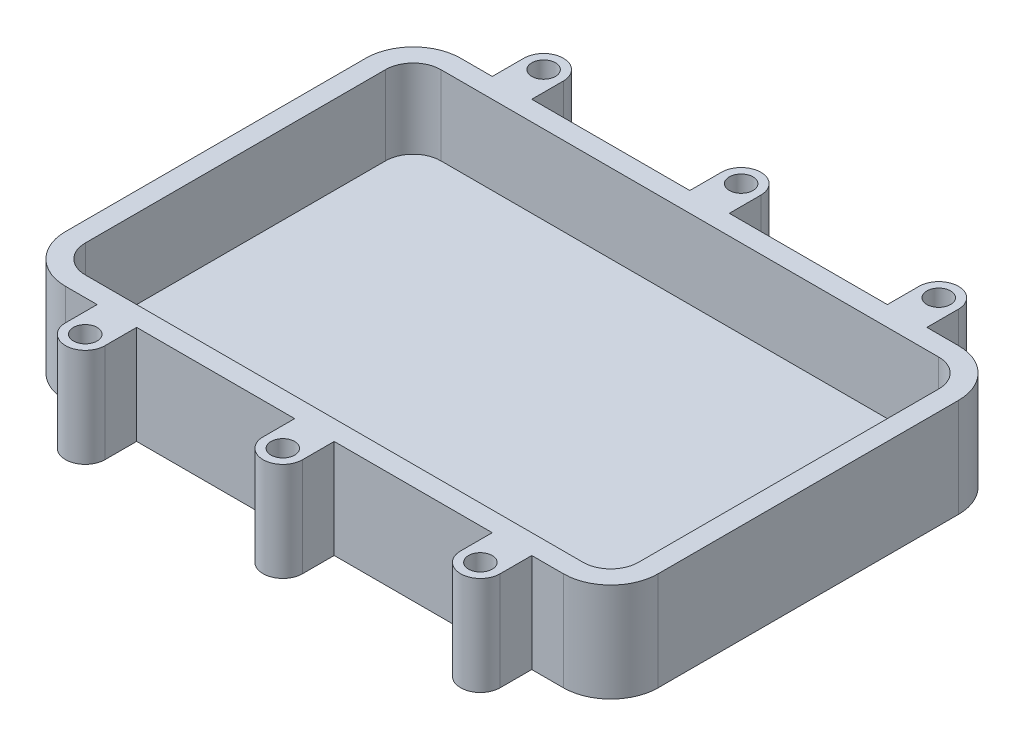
ISO-10303-21;
HEADER;
FILE_DESCRIPTION(('STEP AP214'),'2;1');
FILE_NAME('part.step','',(''),(''),'','','');
FILE_SCHEMA(('AUTOMOTIVE_DESIGN { 1 0 10303 214 1 1 1 1 }'));
ENDSEC;
DATA;
#1=APPLICATION_CONTEXT('core data for automotive mechanical design processes');
#2=APPLICATION_PROTOCOL_DEFINITION('international standard','automotive_design',2000,#1);
#3=PRODUCT_CONTEXT('',#1,'mechanical');
#4=PRODUCT('Part','Part','',(#3));
#5=PRODUCT_RELATED_PRODUCT_CATEGORY('part','',(#4));
#6=PRODUCT_DEFINITION_FORMATION('','',#4);
#7=PRODUCT_DEFINITION_CONTEXT('part definition',#1,'design');
#8=PRODUCT_DEFINITION('design','',#6,#7);
#9=PRODUCT_DEFINITION_SHAPE('','',#8);
#10=(LENGTH_UNIT() NAMED_UNIT(*) SI_UNIT(.MILLI.,.METRE.));
#11=(NAMED_UNIT(*) PLANE_ANGLE_UNIT() SI_UNIT($,.RADIAN.));
#12=(NAMED_UNIT(*) SI_UNIT($,.STERADIAN.) SOLID_ANGLE_UNIT());
#13=UNCERTAINTY_MEASURE_WITH_UNIT(LENGTH_MEASURE(1.E-05),#10,'distance_accuracy_value','');
#14=(GEOMETRIC_REPRESENTATION_CONTEXT(3) GLOBAL_UNCERTAINTY_ASSIGNED_CONTEXT((#13)) GLOBAL_UNIT_ASSIGNED_CONTEXT((#10,
#11,#12)) REPRESENTATION_CONTEXT('',''));
#15=CARTESIAN_POINT('',(0.,0.,0.));
#16=DIRECTION('',(0.,0.,1.));
#17=DIRECTION('',(1.,0.,0.));
#18=AXIS2_PLACEMENT_3D('',#15,#16,#17);
#19=CARTESIAN_POINT('',(-63.,0.,-38.));
#20=DIRECTION('',(0.,-1.,0.));
#21=DIRECTION('',(0.,0.,-1.));
#22=AXIS2_PLACEMENT_3D('',#19,#20,#21);
#23=PLANE('',#22);
#24=CARTESIAN_POINT('',(50.,0.,58.));
#25=DIRECTION('',(0.,1.,0.));
#26=DIRECTION('',(0.,0.,1.));
#27=AXIS2_PLACEMENT_3D('',#24,#25,#26);
#28=CIRCLE('',#27,3.);
#29=CARTESIAN_POINT('',(50.,0.,61.));
#30=VERTEX_POINT('',#29);
#31=EDGE_CURVE('E1111',#30,#30,#28,.T.);
#32=ORIENTED_EDGE('',*,*,#31,.T.);
#33=EDGE_LOOP('',(#32));
#34=FACE_BOUND('',#33,.T.);
#35=CARTESIAN_POINT('',(0.,0.,-58.));
#36=DIRECTION('',(0.,1.,0.));
#37=DIRECTION('',(0.,0.,1.));
#38=AXIS2_PLACEMENT_3D('',#35,#36,#37);
#39=CIRCLE('',#38,2.99999999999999);
#40=CARTESIAN_POINT('',(0.,0.,-55.));
#41=VERTEX_POINT('',#40);
#42=EDGE_CURVE('E369',#41,#41,#39,.T.);
#43=ORIENTED_EDGE('',*,*,#42,.T.);
#44=EDGE_LOOP('',(#43));
#45=FACE_BOUND('',#44,.T.);
#46=CARTESIAN_POINT('',(-50.,0.,-58.));
#47=DIRECTION('',(0.,1.,0.));
#48=DIRECTION('',(0.,0.,1.));
#49=AXIS2_PLACEMENT_3D('',#46,#47,#48);
#50=CIRCLE('',#49,3.);
#51=CARTESIAN_POINT('',(-50.,0.,-55.));
#52=VERTEX_POINT('',#51);
#53=EDGE_CURVE('E389',#52,#52,#50,.T.);
#54=ORIENTED_EDGE('',*,*,#53,.T.);
#55=EDGE_LOOP('',(#54));
#56=FACE_BOUND('',#55,.T.);
#57=CARTESIAN_POINT('',(-63.,0.,-38.));
#58=DIRECTION('',(0.,1.,0.));
#59=DIRECTION('',(0.,0.,-1.));
#60=AXIS2_PLACEMENT_3D('',#57,#58,#59);
#61=CIRCLE('',#60,12.);
#62=CARTESIAN_POINT('',(-63.,0.,-50.));
#63=VERTEX_POINT('',#62);
#64=CARTESIAN_POINT('',(-75.,0.,-38.));
#65=VERTEX_POINT('',#64);
#66=EDGE_CURVE('E484',#63,#65,#61,.T.);
#67=ORIENTED_EDGE('',*,*,#66,.F.);
#68=DIRECTION('',(-1.,0.,0.));
#69=VECTOR('',#68,1.);
#70=CARTESIAN_POINT('',(63.,0.,-50.));
#71=LINE('',#70,#69);
#72=CARTESIAN_POINT('',(-55.,0.,-50.));
#73=VERTEX_POINT('',#72);
#74=EDGE_CURVE('E554',#73,#63,#71,.T.);
#75=ORIENTED_EDGE('',*,*,#74,.F.);
#76=DIRECTION('',(0.,0.,1.));
#77=VECTOR('',#76,1.);
#78=CARTESIAN_POINT('',(-55.,0.,-50.));
#79=LINE('',#78,#77);
#80=CARTESIAN_POINT('',(-55.,0.,-58.));
#81=VERTEX_POINT('',#80);
#82=EDGE_CURVE('E437',#81,#73,#79,.T.);
#83=ORIENTED_EDGE('',*,*,#82,.F.);
#84=CARTESIAN_POINT('',(-50.,0.,-58.));
#85=DIRECTION('',(0.,1.,0.));
#86=DIRECTION('',(0.,0.,1.));
#87=AXIS2_PLACEMENT_3D('',#84,#85,#86);
#88=CIRCLE('',#87,5.);
#89=CARTESIAN_POINT('',(-45.,0.,-58.));
#90=VERTEX_POINT('',#89);
#91=EDGE_CURVE('E434',#90,#81,#88,.T.);
#92=ORIENTED_EDGE('',*,*,#91,.F.);
#93=DIRECTION('',(0.,0.,-1.));
#94=VECTOR('',#93,1.);
#95=CARTESIAN_POINT('',(-45.,0.,-50.));
#96=LINE('',#95,#94);
#97=CARTESIAN_POINT('',(-45.,0.,-50.));
#98=VERTEX_POINT('',#97);
#99=EDGE_CURVE('E431',#98,#90,#96,.T.);
#100=ORIENTED_EDGE('',*,*,#99,.F.);
#101=CARTESIAN_POINT('',(-5.,0.,-50.));
#102=VERTEX_POINT('',#101);
#103=EDGE_CURVE('E559',#102,#98,#71,.T.);
#104=ORIENTED_EDGE('',*,*,#103,.F.);
#105=DIRECTION('',(0.,0.,1.));
#106=VECTOR('',#105,1.);
#107=CARTESIAN_POINT('',(-5.,0.,-50.));
#108=LINE('',#107,#106);
#109=CARTESIAN_POINT('',(-5.,0.,-58.));
#110=VERTEX_POINT('',#109);
#111=EDGE_CURVE('E464',#110,#102,#108,.T.);
#112=ORIENTED_EDGE('',*,*,#111,.F.);
#113=CARTESIAN_POINT('',(0.,0.,-58.));
#114=DIRECTION('',(0.,1.,0.));
#115=DIRECTION('',(0.,0.,1.));
#116=AXIS2_PLACEMENT_3D('',#113,#114,#115);
#117=CIRCLE('',#116,5.);
#118=CARTESIAN_POINT('',(5.,0.,-58.));
#119=VERTEX_POINT('',#118);
#120=EDGE_CURVE('E461',#119,#110,#117,.T.);
#121=ORIENTED_EDGE('',*,*,#120,.F.);
#122=DIRECTION('',(0.,0.,-1.));
#123=VECTOR('',#122,1.);
#124=CARTESIAN_POINT('',(5.,0.,-50.));
#125=LINE('',#124,#123);
#126=CARTESIAN_POINT('',(5.,0.,-50.));
#127=VERTEX_POINT('',#126);
#128=EDGE_CURVE('E458',#127,#119,#125,.T.);
#129=ORIENTED_EDGE('',*,*,#128,.F.);
#130=CARTESIAN_POINT('',(45.,0.,-50.));
#131=VERTEX_POINT('',#130);
#132=EDGE_CURVE('E558',#131,#127,#71,.T.);
#133=ORIENTED_EDGE('',*,*,#132,.F.);
#134=DIRECTION('',(0.,0.,1.));
#135=VECTOR('',#134,1.);
#136=CARTESIAN_POINT('',(45.,0.,-50.));
#137=LINE('',#136,#135);
#138=CARTESIAN_POINT('',(45.,0.,-58.));
#139=VERTEX_POINT('',#138);
#140=EDGE_CURVE('E407',#139,#131,#137,.T.);
#141=ORIENTED_EDGE('',*,*,#140,.F.);
#142=CARTESIAN_POINT('',(50.,0.,-58.));
#143=DIRECTION('',(0.,1.,0.));
#144=DIRECTION('',(0.,0.,-1.));
#145=AXIS2_PLACEMENT_3D('',#142,#143,#144);
#146=CIRCLE('',#145,5.);
#147=CARTESIAN_POINT('',(55.,0.,-58.));
#148=VERTEX_POINT('',#147);
#149=EDGE_CURVE('E404',#148,#139,#146,.T.);
#150=ORIENTED_EDGE('',*,*,#149,.F.);
#151=DIRECTION('',(0.,0.,-1.));
#152=VECTOR('',#151,1.);
#153=CARTESIAN_POINT('',(55.,0.,-50.));
#154=LINE('',#153,#152);
#155=CARTESIAN_POINT('',(55.,0.,-50.));
#156=VERTEX_POINT('',#155);
#157=EDGE_CURVE('E410',#156,#148,#154,.T.);
#158=ORIENTED_EDGE('',*,*,#157,.F.);
#159=CARTESIAN_POINT('',(63.,0.,-50.));
#160=VERTEX_POINT('',#159);
#161=EDGE_CURVE('E555',#160,#156,#71,.T.);
#162=ORIENTED_EDGE('',*,*,#161,.F.);
#163=CARTESIAN_POINT('',(63.,0.,-38.));
#164=DIRECTION('',(0.,1.,0.));
#165=DIRECTION('',(0.,0.,-1.));
#166=AXIS2_PLACEMENT_3D('',#163,#164,#165);
#167=CIRCLE('',#166,12.);
#168=CARTESIAN_POINT('',(75.,0.,-38.));
#169=VERTEX_POINT('',#168);
#170=EDGE_CURVE('E552',#169,#160,#167,.T.);
#171=ORIENTED_EDGE('',*,*,#170,.F.);
#172=DIRECTION('',(0.,0.,-1.));
#173=VECTOR('',#172,1.);
#174=CARTESIAN_POINT('',(75.,0.,-38.));
#175=LINE('',#174,#173);
#176=CARTESIAN_POINT('',(75.,0.,38.));
#177=VERTEX_POINT('',#176);
#178=EDGE_CURVE('E550',#177,#169,#175,.T.);
#179=ORIENTED_EDGE('',*,*,#178,.F.);
#180=CARTESIAN_POINT('',(63.,0.,38.));
#181=DIRECTION('',(0.,1.,0.));
#182=DIRECTION('',(0.,0.,-1.));
#183=AXIS2_PLACEMENT_3D('',#180,#181,#182);
#184=CIRCLE('',#183,12.);
#185=CARTESIAN_POINT('',(63.,0.,50.));
#186=VERTEX_POINT('',#185);
#187=EDGE_CURVE('E546',#186,#177,#184,.T.);
#188=ORIENTED_EDGE('',*,*,#187,.F.);
#189=DIRECTION('',(1.,0.,0.));
#190=VECTOR('',#189,1.);
#191=CARTESIAN_POINT('',(63.,0.,50.));
#192=LINE('',#191,#190);
#193=CARTESIAN_POINT('',(55.,0.,50.));
#194=VERTEX_POINT('',#193);
#195=EDGE_CURVE('E542',#194,#186,#192,.T.);
#196=ORIENTED_EDGE('',*,*,#195,.F.);
#197=DIRECTION('',(0.,0.,1.));
#198=VECTOR('',#197,1.);
#199=CARTESIAN_POINT('',(55.,0.,50.));
#200=LINE('',#199,#198);
#201=CARTESIAN_POINT('',(55.,0.,58.));
#202=VERTEX_POINT('',#201);
#203=EDGE_CURVE('E321',#194,#202,#200,.T.);
#204=ORIENTED_EDGE('',*,*,#203,.T.);
#205=CARTESIAN_POINT('',(50.,0.,58.));
#206=DIRECTION('',(0.,-1.,0.));
#207=DIRECTION('',(0.,0.,1.));
#208=AXIS2_PLACEMENT_3D('',#205,#206,#207);
#209=CIRCLE('',#208,5.);
#210=CARTESIAN_POINT('',(45.,0.,58.));
#211=VERTEX_POINT('',#210);
#212=EDGE_CURVE('E304',#202,#211,#209,.T.);
#213=ORIENTED_EDGE('',*,*,#212,.T.);
#214=DIRECTION('',(0.,0.,-1.));
#215=VECTOR('',#214,1.);
#216=CARTESIAN_POINT('',(45.,0.,50.));
#217=LINE('',#216,#215);
#218=CARTESIAN_POINT('',(45.,0.,50.));
#219=VERTEX_POINT('',#218);
#220=EDGE_CURVE('E305',#211,#219,#217,.T.);
#221=ORIENTED_EDGE('',*,*,#220,.T.);
#222=CARTESIAN_POINT('',(5.,0.,50.));
#223=VERTEX_POINT('',#222);
#224=EDGE_CURVE('E548',#223,#219,#192,.T.);
#225=ORIENTED_EDGE('',*,*,#224,.F.);
#226=DIRECTION('',(0.,0.,1.));
#227=VECTOR('',#226,1.);
#228=CARTESIAN_POINT('',(5.,0.,50.));
#229=LINE('',#228,#227);
#230=CARTESIAN_POINT('',(5.,0.,58.));
#231=VERTEX_POINT('',#230);
#232=EDGE_CURVE('E364',#223,#231,#229,.T.);
#233=ORIENTED_EDGE('',*,*,#232,.T.);
#234=CARTESIAN_POINT('',(0.,0.,58.));
#235=DIRECTION('',(0.,-1.,0.));
#236=DIRECTION('',(0.,0.,-1.));
#237=AXIS2_PLACEMENT_3D('',#234,#235,#236);
#238=CIRCLE('',#237,5.);
#239=CARTESIAN_POINT('',(-5.,0.,58.));
#240=VERTEX_POINT('',#239);
#241=EDGE_CURVE('E362',#231,#240,#238,.T.);
#242=ORIENTED_EDGE('',*,*,#241,.T.);
#243=DIRECTION('',(0.,0.,-1.));
#244=VECTOR('',#243,1.);
#245=CARTESIAN_POINT('',(-5.,0.,50.));
#246=LINE('',#245,#244);
#247=CARTESIAN_POINT('',(-5.,0.,50.));
#248=VERTEX_POINT('',#247);
#249=EDGE_CURVE('E359',#240,#248,#246,.T.);
#250=ORIENTED_EDGE('',*,*,#249,.T.);
#251=CARTESIAN_POINT('',(-45.,0.,50.));
#252=VERTEX_POINT('',#251);
#253=EDGE_CURVE('E547',#252,#248,#192,.T.);
#254=ORIENTED_EDGE('',*,*,#253,.F.);
#255=DIRECTION('',(0.,0.,1.));
#256=VECTOR('',#255,1.);
#257=CARTESIAN_POINT('',(-45.,0.,50.));
#258=LINE('',#257,#256);
#259=CARTESIAN_POINT('',(-45.,0.,58.));
#260=VERTEX_POINT('',#259);
#261=EDGE_CURVE('E340',#252,#260,#258,.T.);
#262=ORIENTED_EDGE('',*,*,#261,.T.);
#263=CARTESIAN_POINT('',(-50.,0.,58.));
#264=DIRECTION('',(0.,-1.,0.));
#265=DIRECTION('',(0.,0.,-1.));
#266=AXIS2_PLACEMENT_3D('',#263,#264,#265);
#267=CIRCLE('',#266,5.);
#268=CARTESIAN_POINT('',(-55.,0.,58.));
#269=VERTEX_POINT('',#268);
#270=EDGE_CURVE('E338',#260,#269,#267,.T.);
#271=ORIENTED_EDGE('',*,*,#270,.T.);
#272=DIRECTION('',(0.,0.,-1.));
#273=VECTOR('',#272,1.);
#274=CARTESIAN_POINT('',(-55.,0.,50.));
#275=LINE('',#274,#273);
#276=CARTESIAN_POINT('',(-55.,0.,50.));
#277=VERTEX_POINT('',#276);
#278=EDGE_CURVE('E336',#269,#277,#275,.T.);
#279=ORIENTED_EDGE('',*,*,#278,.T.);
#280=CARTESIAN_POINT('',(-63.,0.,50.));
#281=VERTEX_POINT('',#280);
#282=EDGE_CURVE('E543',#281,#277,#192,.T.);
#283=ORIENTED_EDGE('',*,*,#282,.F.);
#284=CARTESIAN_POINT('',(-63.,0.,38.));
#285=DIRECTION('',(0.,1.,0.));
#286=DIRECTION('',(0.,0.,-1.));
#287=AXIS2_PLACEMENT_3D('',#284,#285,#286);
#288=CIRCLE('',#287,12.);
#289=CARTESIAN_POINT('',(-75.,0.,38.));
#290=VERTEX_POINT('',#289);
#291=EDGE_CURVE('E540',#290,#281,#288,.T.);
#292=ORIENTED_EDGE('',*,*,#291,.F.);
#293=DIRECTION('',(0.,0.,1.));
#294=VECTOR('',#293,1.);
#295=CARTESIAN_POINT('',(-75.,0.,-38.));
#296=LINE('',#295,#294);
#297=EDGE_CURVE('E538',#65,#290,#296,.T.);
#298=ORIENTED_EDGE('',*,*,#297,.F.);
#299=EDGE_LOOP('',(#67,#75,#83,#92,#100,#104,#112,#121,#129,#133,#141,#150,#158,#162,#171,#179,
#188,#196,#204,#213,#221,#225,#233,#242,#250,#254,#262,#271,#279,#283,#292,#298));
#300=FACE_BOUND('',#299,.T.);
#301=CARTESIAN_POINT('',(50.,0.,-58.));
#302=DIRECTION('',(0.,1.,0.));
#303=DIRECTION('',(0.,0.,1.));
#304=AXIS2_PLACEMENT_3D('',#301,#302,#303);
#305=CIRCLE('',#304,3.);
#306=CARTESIAN_POINT('',(50.,0.,-55.));
#307=VERTEX_POINT('',#306);
#308=EDGE_CURVE('E383',#307,#307,#305,.T.);
#309=ORIENTED_EDGE('',*,*,#308,.T.);
#310=EDGE_LOOP('',(#309));
#311=FACE_BOUND('',#310,.T.);
#312=CARTESIAN_POINT('',(-50.,0.,58.));
#313=DIRECTION('',(0.,1.,0.));
#314=DIRECTION('',(0.,0.,1.));
#315=AXIS2_PLACEMENT_3D('',#312,#313,#314);
#316=CIRCLE('',#315,3.);
#317=CARTESIAN_POINT('',(-50.,0.,60.9999999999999));
#318=VERTEX_POINT('',#317);
#319=EDGE_CURVE('E315',#318,#318,#316,.T.);
#320=ORIENTED_EDGE('',*,*,#319,.T.);
#321=EDGE_LOOP('',(#320));
#322=FACE_BOUND('',#321,.T.);
#323=CARTESIAN_POINT('',(0.,0.,58.));
#324=DIRECTION('',(0.,1.,0.));
#325=DIRECTION('',(0.,0.,1.));
#326=AXIS2_PLACEMENT_3D('',#323,#324,#325);
#327=CIRCLE('',#326,2.99999999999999);
#328=CARTESIAN_POINT('',(0.,0.,61.));
#329=VERTEX_POINT('',#328);
#330=EDGE_CURVE('E1107',#329,#329,#327,.T.);
#331=ORIENTED_EDGE('',*,*,#330,.T.);
#332=EDGE_LOOP('',(#331));
#333=FACE_BOUND('',#332,.T.);
#334=ADVANCED_FACE('F33',(#34,#45,#56,#300,#311,#322,#333),#23,.T.);
#335=CARTESIAN_POINT('',(63.,25.,50.));
#336=DIRECTION('',(0.,0.,-1.));
#337=DIRECTION('',(-1.,0.,0.));
#338=AXIS2_PLACEMENT_3D('',#335,#336,#337);
#339=PLANE('',#338);
#340=DIRECTION('',(0.,1.,0.));
#341=VECTOR('',#340,1.);
#342=CARTESIAN_POINT('',(45.,0.,50.));
#343=LINE('',#342,#341);
#344=CARTESIAN_POINT('',(45.,25.,50.));
#345=VERTEX_POINT('',#344);
#346=EDGE_CURVE('E327',#219,#345,#343,.T.);
#347=ORIENTED_EDGE('',*,*,#346,.T.);
#348=DIRECTION('',(1.,0.,0.));
#349=VECTOR('',#348,1.);
#350=CARTESIAN_POINT('',(63.,25.,50.));
#351=LINE('',#350,#349);
#352=CARTESIAN_POINT('',(5.,25.,50.));
#353=VERTEX_POINT('',#352);
#354=EDGE_CURVE('E571',#353,#345,#351,.T.);
#355=ORIENTED_EDGE('',*,*,#354,.F.);
#356=DIRECTION('',(0.,1.,0.));
#357=VECTOR('',#356,1.);
#358=CARTESIAN_POINT('',(5.,0.,50.));
#359=LINE('',#358,#357);
#360=EDGE_CURVE('E367',#223,#353,#359,.T.);
#361=ORIENTED_EDGE('',*,*,#360,.F.);
#362=ORIENTED_EDGE('',*,*,#224,.T.);
#363=EDGE_LOOP('',(#347,#355,#361,#362));
#364=FACE_BOUND('',#363,.T.);
#365=ADVANCED_FACE('F713',(#364),#339,.F.);
#366=DIRECTION('',(0.,1.,0.));
#367=VECTOR('',#366,1.);
#368=CARTESIAN_POINT('',(55.,0.,50.));
#369=LINE('',#368,#367);
#370=CARTESIAN_POINT('',(55.,25.,50.));
#371=VERTEX_POINT('',#370);
#372=EDGE_CURVE('E294',#194,#371,#369,.T.);
#373=ORIENTED_EDGE('',*,*,#372,.F.);
#374=ORIENTED_EDGE('',*,*,#195,.T.);
#375=DIRECTION('',(0.,-1.,0.));
#376=VECTOR('',#375,1.);
#377=CARTESIAN_POINT('',(63.,25.,50.));
#378=LINE('',#377,#376);
#379=CARTESIAN_POINT('',(63.,25.,50.));
#380=VERTEX_POINT('',#379);
#381=EDGE_CURVE('E595',#380,#186,#378,.T.);
#382=ORIENTED_EDGE('',*,*,#381,.F.);
#383=EDGE_CURVE('E565',#371,#380,#351,.T.);
#384=ORIENTED_EDGE('',*,*,#383,.F.);
#385=EDGE_LOOP('',(#373,#374,#382,#384));
#386=FACE_BOUND('',#385,.T.);
#387=ADVANCED_FACE('F695',(#386),#339,.F.);
#388=DIRECTION('',(0.,1.,0.));
#389=VECTOR('',#388,1.);
#390=CARTESIAN_POINT('',(-45.,0.,50.));
#391=LINE('',#390,#389);
#392=CARTESIAN_POINT('',(-45.,25.,50.));
#393=VERTEX_POINT('',#392);
#394=EDGE_CURVE('E56',#252,#393,#391,.T.);
#395=ORIENTED_EDGE('',*,*,#394,.F.);
#396=ORIENTED_EDGE('',*,*,#253,.T.);
#397=DIRECTION('',(0.,1.,0.));
#398=VECTOR('',#397,1.);
#399=CARTESIAN_POINT('',(-5.,0.,50.));
#400=LINE('',#399,#398);
#401=CARTESIAN_POINT('',(-5.,25.,50.));
#402=VERTEX_POINT('',#401);
#403=EDGE_CURVE('E366',#248,#402,#400,.T.);
#404=ORIENTED_EDGE('',*,*,#403,.T.);
#405=EDGE_CURVE('E570',#393,#402,#351,.T.);
#406=ORIENTED_EDGE('',*,*,#405,.F.);
#407=EDGE_LOOP('',(#395,#396,#404,#406));
#408=FACE_BOUND('',#407,.T.);
#409=ADVANCED_FACE('F699',(#408),#339,.F.);
#410=DIRECTION('',(0.,1.,0.));
#411=VECTOR('',#410,1.);
#412=CARTESIAN_POINT('',(-55.,0.,50.));
#413=LINE('',#412,#411);
#414=CARTESIAN_POINT('',(-55.,25.,50.));
#415=VERTEX_POINT('',#414);
#416=EDGE_CURVE('E342',#277,#415,#413,.T.);
#417=ORIENTED_EDGE('',*,*,#416,.T.);
#418=CARTESIAN_POINT('',(-63.,25.,50.));
#419=VERTEX_POINT('',#418);
#420=EDGE_CURVE('E566',#419,#415,#351,.T.);
#421=ORIENTED_EDGE('',*,*,#420,.F.);
#422=DIRECTION('',(0.,-1.,0.));
#423=VECTOR('',#422,1.);
#424=CARTESIAN_POINT('',(-63.,25.,50.));
#425=LINE('',#424,#423);
#426=EDGE_CURVE('E598',#419,#281,#425,.T.);
#427=ORIENTED_EDGE('',*,*,#426,.T.);
#428=ORIENTED_EDGE('',*,*,#282,.T.);
#429=EDGE_LOOP('',(#417,#421,#427,#428));
#430=FACE_BOUND('',#429,.T.);
#431=ADVANCED_FACE('F615',(#430),#339,.F.);
#432=CARTESIAN_POINT('',(63.,25.,-50.));
#433=DIRECTION('',(0.,0.,1.));
#434=DIRECTION('',(1.,0.,0.));
#435=AXIS2_PLACEMENT_3D('',#432,#433,#434);
#436=PLANE('',#435);
#437=ORIENTED_EDGE('',*,*,#161,.T.);
#438=DIRECTION('',(0.,1.,0.));
#439=VECTOR('',#438,1.);
#440=CARTESIAN_POINT('',(55.,0.,-50.));
#441=LINE('',#440,#439);
#442=CARTESIAN_POINT('',(55.,25.,-50.));
#443=VERTEX_POINT('',#442);
#444=EDGE_CURVE('E417',#156,#443,#441,.T.);
#445=ORIENTED_EDGE('',*,*,#444,.T.);
#446=DIRECTION('',(-1.,0.,0.));
#447=VECTOR('',#446,1.);
#448=CARTESIAN_POINT('',(63.,25.,-50.));
#449=LINE('',#448,#447);
#450=CARTESIAN_POINT('',(63.,25.,-50.));
#451=VERTEX_POINT('',#450);
#452=EDGE_CURVE('E578',#451,#443,#449,.T.);
#453=ORIENTED_EDGE('',*,*,#452,.F.);
#454=DIRECTION('',(0.,-1.,0.));
#455=VECTOR('',#454,1.);
#456=CARTESIAN_POINT('',(63.,25.,-50.));
#457=LINE('',#456,#455);
#458=EDGE_CURVE('E586',#451,#160,#457,.T.);
#459=ORIENTED_EDGE('',*,*,#458,.T.);
#460=EDGE_LOOP('',(#437,#445,#453,#459));
#461=FACE_BOUND('',#460,.T.);
#462=ADVANCED_FACE('F676',(#461),#436,.F.);
#463=CARTESIAN_POINT('',(-55.,25.,-50.));
#464=VERTEX_POINT('',#463);
#465=CARTESIAN_POINT('',(-63.,25.,-50.));
#466=VERTEX_POINT('',#465);
#467=EDGE_CURVE('E577',#464,#466,#449,.T.);
#468=ORIENTED_EDGE('',*,*,#467,.F.);
#469=DIRECTION('',(0.,1.,0.));
#470=VECTOR('',#469,1.);
#471=CARTESIAN_POINT('',(-55.,0.,-50.));
#472=LINE('',#471,#470);
#473=EDGE_CURVE('E441',#73,#464,#472,.T.);
#474=ORIENTED_EDGE('',*,*,#473,.F.);
#475=ORIENTED_EDGE('',*,*,#74,.T.);
#476=DIRECTION('',(0.,-1.,0.));
#477=VECTOR('',#476,1.);
#478=CARTESIAN_POINT('',(-63.,25.,-50.));
#479=LINE('',#478,#477);
#480=EDGE_CURVE('E581',#466,#63,#479,.T.);
#481=ORIENTED_EDGE('',*,*,#480,.F.);
#482=EDGE_LOOP('',(#468,#474,#475,#481));
#483=FACE_BOUND('',#482,.T.);
#484=ADVANCED_FACE('F628',(#483),#436,.F.);
#485=ORIENTED_EDGE('',*,*,#103,.T.);
#486=DIRECTION('',(0.,1.,0.));
#487=VECTOR('',#486,1.);
#488=CARTESIAN_POINT('',(-45.,0.,-50.));
#489=LINE('',#488,#487);
#490=CARTESIAN_POINT('',(-45.,25.,-50.));
#491=VERTEX_POINT('',#490);
#492=EDGE_CURVE('E440',#98,#491,#489,.T.);
#493=ORIENTED_EDGE('',*,*,#492,.T.);
#494=CARTESIAN_POINT('',(-5.,25.,-50.));
#495=VERTEX_POINT('',#494);
#496=EDGE_CURVE('E583',#495,#491,#449,.T.);
#497=ORIENTED_EDGE('',*,*,#496,.F.);
#498=DIRECTION('',(0.,1.,0.));
#499=VECTOR('',#498,1.);
#500=CARTESIAN_POINT('',(-5.,0.,-50.));
#501=LINE('',#500,#499);
#502=EDGE_CURVE('E468',#102,#495,#501,.T.);
#503=ORIENTED_EDGE('',*,*,#502,.F.);
#504=EDGE_LOOP('',(#485,#493,#497,#503));
#505=FACE_BOUND('',#504,.T.);
#506=ADVANCED_FACE('F642',(#505),#436,.F.);
#507=CARTESIAN_POINT('',(-63.,25.,-38.));
#508=DIRECTION('',(0.,-1.,0.));
#509=DIRECTION('',(0.,0.,-1.));
#510=AXIS2_PLACEMENT_3D('',#507,#508,#509);
#511=PLANE('',#510);
#512=CARTESIAN_POINT('',(0.,25.,58.));
#513=DIRECTION('',(0.,1.,0.));
#514=DIRECTION('',(0.,0.,1.));
#515=AXIS2_PLACEMENT_3D('',#512,#513,#514);
#516=CIRCLE('',#515,2.99999999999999);
#517=CARTESIAN_POINT('',(0.,25.,61.));
#518=VERTEX_POINT('',#517);
#519=EDGE_CURVE('E1110',#518,#518,#516,.T.);
#520=ORIENTED_EDGE('',*,*,#519,.F.);
#521=EDGE_LOOP('',(#520));
#522=FACE_BOUND('',#521,.T.);
#523=CARTESIAN_POINT('',(50.,25.,58.));
#524=DIRECTION('',(0.,1.,0.));
#525=DIRECTION('',(0.,0.,1.));
#526=AXIS2_PLACEMENT_3D('',#523,#524,#525);
#527=CIRCLE('',#526,2.99999999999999);
#528=CARTESIAN_POINT('',(50.,25.,61.));
#529=VERTEX_POINT('',#528);
#530=EDGE_CURVE('E1113',#529,#529,#527,.T.);
#531=ORIENTED_EDGE('',*,*,#530,.F.);
#532=EDGE_LOOP('',(#531));
#533=FACE_BOUND('',#532,.T.);
#534=CARTESIAN_POINT('',(-50.,25.,58.));
#535=DIRECTION('',(0.,1.,0.));
#536=DIRECTION('',(0.,0.,1.));
#537=AXIS2_PLACEMENT_3D('',#534,#535,#536);
#538=CIRCLE('',#537,2.99999999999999);
#539=CARTESIAN_POINT('',(-50.,25.,60.9999999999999));
#540=VERTEX_POINT('',#539);
#541=EDGE_CURVE('E312',#540,#540,#538,.T.);
#542=ORIENTED_EDGE('',*,*,#541,.F.);
#543=EDGE_LOOP('',(#542));
#544=FACE_BOUND('',#543,.T.);
#545=CARTESIAN_POINT('',(0.,25.,-58.));
#546=DIRECTION('',(0.,1.,0.));
#547=DIRECTION('',(0.,0.,1.));
#548=AXIS2_PLACEMENT_3D('',#545,#546,#547);
#549=CIRCLE('',#548,2.99999999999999);
#550=CARTESIAN_POINT('',(0.,25.,-55.));
#551=VERTEX_POINT('',#550);
#552=EDGE_CURVE('E380',#551,#551,#549,.T.);
#553=ORIENTED_EDGE('',*,*,#552,.F.);
#554=EDGE_LOOP('',(#553));
#555=FACE_BOUND('',#554,.T.);
#556=CARTESIAN_POINT('',(50.,25.,-58.));
#557=DIRECTION('',(0.,1.,0.));
#558=DIRECTION('',(0.,0.,1.));
#559=AXIS2_PLACEMENT_3D('',#556,#557,#558);
#560=CIRCLE('',#559,2.99999999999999);
#561=CARTESIAN_POINT('',(50.,25.,-55.));
#562=VERTEX_POINT('',#561);
#563=EDGE_CURVE('E386',#562,#562,#560,.T.);
#564=ORIENTED_EDGE('',*,*,#563,.F.);
#565=EDGE_LOOP('',(#564));
#566=FACE_BOUND('',#565,.T.);
#567=CARTESIAN_POINT('',(-50.,25.,-58.));
#568=DIRECTION('',(0.,1.,0.));
#569=DIRECTION('',(0.,0.,1.));
#570=AXIS2_PLACEMENT_3D('',#567,#568,#569);
#571=CIRCLE('',#570,2.99999999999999);
#572=CARTESIAN_POINT('',(-50.,25.,-55.));
#573=VERTEX_POINT('',#572);
#574=EDGE_CURVE('E392',#573,#573,#571,.T.);
#575=ORIENTED_EDGE('',*,*,#574,.F.);
#576=EDGE_LOOP('',(#575));
#577=FACE_BOUND('',#576,.T.);
#578=CARTESIAN_POINT('',(-63.,25.,-38.));
#579=DIRECTION('',(0.,1.,0.));
#580=DIRECTION('',(0.,0.,-1.));
#581=AXIS2_PLACEMENT_3D('',#578,#579,#580);
#582=CIRCLE('',#581,12.);
#583=CARTESIAN_POINT('',(-75.,25.,-38.));
#584=VERTEX_POINT('',#583);
#585=EDGE_CURVE('E557',#466,#584,#582,.T.);
#586=ORIENTED_EDGE('',*,*,#585,.T.);
#587=DIRECTION('',(0.,0.,1.));
#588=VECTOR('',#587,1.);
#589=CARTESIAN_POINT('',(-75.,25.,-38.));
#590=LINE('',#589,#588);
#591=CARTESIAN_POINT('',(-75.,25.,38.));
#592=VERTEX_POINT('',#591);
#593=EDGE_CURVE('E561',#584,#592,#590,.T.);
#594=ORIENTED_EDGE('',*,*,#593,.T.);
#595=CARTESIAN_POINT('',(-63.,25.,38.));
#596=DIRECTION('',(0.,1.,0.));
#597=DIRECTION('',(0.,0.,-1.));
#598=AXIS2_PLACEMENT_3D('',#595,#596,#597);
#599=CIRCLE('',#598,12.);
#600=EDGE_CURVE('E563',#592,#419,#599,.T.);
#601=ORIENTED_EDGE('',*,*,#600,.T.);
#602=ORIENTED_EDGE('',*,*,#420,.T.);
#603=DIRECTION('',(0.,0.,-1.));
#604=VECTOR('',#603,1.);
#605=CARTESIAN_POINT('',(-55.,25.,50.));
#606=LINE('',#605,#604);
#607=CARTESIAN_POINT('',(-55.,25.,58.));
#608=VERTEX_POINT('',#607);
#609=EDGE_CURVE('E326',#608,#415,#606,.T.);
#610=ORIENTED_EDGE('',*,*,#609,.F.);
#611=CARTESIAN_POINT('',(-50.,25.,58.));
#612=DIRECTION('',(0.,-1.,0.));
#613=DIRECTION('',(0.,0.,-1.));
#614=AXIS2_PLACEMENT_3D('',#611,#612,#613);
#615=CIRCLE('',#614,5.);
#616=CARTESIAN_POINT('',(-45.,25.,58.));
#617=VERTEX_POINT('',#616);
#618=EDGE_CURVE('E332',#617,#608,#615,.T.);
#619=ORIENTED_EDGE('',*,*,#618,.F.);
#620=DIRECTION('',(0.,0.,1.));
#621=VECTOR('',#620,1.);
#622=CARTESIAN_POINT('',(-45.,25.,50.));
#623=LINE('',#622,#621);
#624=EDGE_CURVE('E334',#393,#617,#623,.T.);
#625=ORIENTED_EDGE('',*,*,#624,.F.);
#626=ORIENTED_EDGE('',*,*,#405,.T.);
#627=DIRECTION('',(0.,0.,-1.));
#628=VECTOR('',#627,1.);
#629=CARTESIAN_POINT('',(-5.,25.,50.));
#630=LINE('',#629,#628);
#631=CARTESIAN_POINT('',(-5.,25.,58.));
#632=VERTEX_POINT('',#631);
#633=EDGE_CURVE('E344',#632,#402,#630,.T.);
#634=ORIENTED_EDGE('',*,*,#633,.F.);
#635=CARTESIAN_POINT('',(0.,25.,58.));
#636=DIRECTION('',(0.,-1.,0.));
#637=DIRECTION('',(0.,0.,-1.));
#638=AXIS2_PLACEMENT_3D('',#635,#636,#637);
#639=CIRCLE('',#638,5.);
#640=CARTESIAN_POINT('',(5.,25.,58.));
#641=VERTEX_POINT('',#640);
#642=EDGE_CURVE('E355',#641,#632,#639,.T.);
#643=ORIENTED_EDGE('',*,*,#642,.F.);
#644=DIRECTION('',(0.,0.,1.));
#645=VECTOR('',#644,1.);
#646=CARTESIAN_POINT('',(5.,25.,50.));
#647=LINE('',#646,#645);
#648=EDGE_CURVE('E357',#353,#641,#647,.T.);
#649=ORIENTED_EDGE('',*,*,#648,.F.);
#650=ORIENTED_EDGE('',*,*,#354,.T.);
#651=DIRECTION('',(0.,0.,-1.));
#652=VECTOR('',#651,1.);
#653=CARTESIAN_POINT('',(45.,25.,50.));
#654=LINE('',#653,#652);
#655=CARTESIAN_POINT('',(45.,25.,58.));
#656=VERTEX_POINT('',#655);
#657=EDGE_CURVE('E296',#656,#345,#654,.T.);
#658=ORIENTED_EDGE('',*,*,#657,.F.);
#659=CARTESIAN_POINT('',(50.,25.,58.));
#660=DIRECTION('',(0.,-1.,0.));
#661=DIRECTION('',(0.,0.,1.));
#662=AXIS2_PLACEMENT_3D('',#659,#660,#661);
#663=CIRCLE('',#662,5.);
#664=CARTESIAN_POINT('',(55.,25.,58.));
#665=VERTEX_POINT('',#664);
#666=EDGE_CURVE('E297',#665,#656,#663,.T.);
#667=ORIENTED_EDGE('',*,*,#666,.F.);
#668=DIRECTION('',(0.,0.,1.));
#669=VECTOR('',#668,1.);
#670=CARTESIAN_POINT('',(55.,25.,50.));
#671=LINE('',#670,#669);
#672=EDGE_CURVE('E48',#371,#665,#671,.T.);
#673=ORIENTED_EDGE('',*,*,#672,.F.);
#674=ORIENTED_EDGE('',*,*,#383,.T.);
#675=CARTESIAN_POINT('',(63.,25.,38.));
#676=DIRECTION('',(0.,1.,0.));
#677=DIRECTION('',(0.,0.,-1.));
#678=AXIS2_PLACEMENT_3D('',#675,#676,#677);
#679=CIRCLE('',#678,12.);
#680=CARTESIAN_POINT('',(75.,25.,38.));
#681=VERTEX_POINT('',#680);
#682=EDGE_CURVE('E569',#380,#681,#679,.T.);
#683=ORIENTED_EDGE('',*,*,#682,.T.);
#684=DIRECTION('',(0.,0.,-1.));
#685=VECTOR('',#684,1.);
#686=CARTESIAN_POINT('',(75.,25.,-38.));
#687=LINE('',#686,#685);
#688=CARTESIAN_POINT('',(75.,25.,-38.));
#689=VERTEX_POINT('',#688);
#690=EDGE_CURVE('E573',#681,#689,#687,.T.);
#691=ORIENTED_EDGE('',*,*,#690,.T.);
#692=CARTESIAN_POINT('',(63.,25.,-38.));
#693=DIRECTION('',(0.,1.,0.));
#694=DIRECTION('',(0.,0.,-1.));
#695=AXIS2_PLACEMENT_3D('',#692,#693,#694);
#696=CIRCLE('',#695,12.);
#697=EDGE_CURVE('E575',#689,#451,#696,.T.);
#698=ORIENTED_EDGE('',*,*,#697,.T.);
#699=ORIENTED_EDGE('',*,*,#452,.T.);
#700=DIRECTION('',(0.,0.,-1.));
#701=VECTOR('',#700,1.);
#702=CARTESIAN_POINT('',(55.,25.,-50.));
#703=LINE('',#702,#701);
#704=CARTESIAN_POINT('',(55.,25.,-58.));
#705=VERTEX_POINT('',#704);
#706=EDGE_CURVE('E401',#443,#705,#703,.T.);
#707=ORIENTED_EDGE('',*,*,#706,.T.);
#708=CARTESIAN_POINT('',(50.,25.,-58.));
#709=DIRECTION('',(0.,1.,0.));
#710=DIRECTION('',(0.,0.,-1.));
#711=AXIS2_PLACEMENT_3D('',#708,#709,#710);
#712=CIRCLE('',#711,5.);
#713=CARTESIAN_POINT('',(45.,25.,-58.));
#714=VERTEX_POINT('',#713);
#715=EDGE_CURVE('E395',#705,#714,#712,.T.);
#716=ORIENTED_EDGE('',*,*,#715,.T.);
#717=DIRECTION('',(0.,0.,1.));
#718=VECTOR('',#717,1.);
#719=CARTESIAN_POINT('',(45.,25.,-50.));
#720=LINE('',#719,#718);
#721=CARTESIAN_POINT('',(45.,25.,-50.));
#722=VERTEX_POINT('',#721);
#723=EDGE_CURVE('E398',#714,#722,#720,.T.);
#724=ORIENTED_EDGE('',*,*,#723,.T.);
#725=CARTESIAN_POINT('',(5.,25.,-50.));
#726=VERTEX_POINT('',#725);
#727=EDGE_CURVE('E582',#722,#726,#449,.T.);
#728=ORIENTED_EDGE('',*,*,#727,.T.);
#729=DIRECTION('',(0.,0.,-1.));
#730=VECTOR('',#729,1.);
#731=CARTESIAN_POINT('',(5.,25.,-50.));
#732=LINE('',#731,#730);
#733=CARTESIAN_POINT('',(5.,25.,-58.));
#734=VERTEX_POINT('',#733);
#735=EDGE_CURVE('E444',#726,#734,#732,.T.);
#736=ORIENTED_EDGE('',*,*,#735,.T.);
#737=CARTESIAN_POINT('',(0.,25.,-58.));
#738=DIRECTION('',(0.,1.,0.));
#739=DIRECTION('',(0.,0.,1.));
#740=AXIS2_PLACEMENT_3D('',#737,#738,#739);
#741=CIRCLE('',#740,5.);
#742=CARTESIAN_POINT('',(-5.,25.,-58.));
#743=VERTEX_POINT('',#742);
#744=EDGE_CURVE('E452',#734,#743,#741,.T.);
#745=ORIENTED_EDGE('',*,*,#744,.T.);
#746=DIRECTION('',(0.,0.,1.));
#747=VECTOR('',#746,1.);
#748=CARTESIAN_POINT('',(-5.,25.,-50.));
#749=LINE('',#748,#747);
#750=EDGE_CURVE('E455',#743,#495,#749,.T.);
#751=ORIENTED_EDGE('',*,*,#750,.T.);
#752=ORIENTED_EDGE('',*,*,#496,.T.);
#753=DIRECTION('',(0.,0.,-1.));
#754=VECTOR('',#753,1.);
#755=CARTESIAN_POINT('',(-45.,25.,-50.));
#756=LINE('',#755,#754);
#757=CARTESIAN_POINT('',(-45.,25.,-58.));
#758=VERTEX_POINT('',#757);
#759=EDGE_CURVE('E416',#491,#758,#756,.T.);
#760=ORIENTED_EDGE('',*,*,#759,.T.);
#761=CARTESIAN_POINT('',(-50.,25.,-58.));
#762=DIRECTION('',(0.,1.,0.));
#763=DIRECTION('',(0.,0.,1.));
#764=AXIS2_PLACEMENT_3D('',#761,#762,#763);
#765=CIRCLE('',#764,5.);
#766=CARTESIAN_POINT('',(-55.,25.,-58.));
#767=VERTEX_POINT('',#766);
#768=EDGE_CURVE('E425',#758,#767,#765,.T.);
#769=ORIENTED_EDGE('',*,*,#768,.T.);
#770=DIRECTION('',(0.,0.,1.));
#771=VECTOR('',#770,1.);
#772=CARTESIAN_POINT('',(-55.,25.,-50.));
#773=LINE('',#772,#771);
#774=EDGE_CURVE('E428',#767,#464,#773,.T.);
#775=ORIENTED_EDGE('',*,*,#774,.T.);
#776=ORIENTED_EDGE('',*,*,#467,.T.);
#777=EDGE_LOOP('',(#586,#594,#601,#602,#610,#619,#625,#626,#634,#643,#649,#650,#658,#667,#673,
#674,#683,#691,#698,#699,#707,#716,#724,#728,#736,#745,#751,#752,#760,#769,#775,#776));
#778=FACE_BOUND('',#777,.T.);
#779=CARTESIAN_POINT('',(-63.,25.,-38.));
#780=DIRECTION('',(0.,-1.,0.));
#781=DIRECTION('',(0.,0.,-1.));
#782=AXIS2_PLACEMENT_3D('',#779,#780,#781);
#783=CIRCLE('',#782,6.99999999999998);
#784=CARTESIAN_POINT('',(-63.,25.,-45.));
#785=VERTEX_POINT('',#784);
#786=CARTESIAN_POINT('',(-70.,25.,-38.));
#787=VERTEX_POINT('',#786);
#788=EDGE_CURVE('E520',#785,#787,#783,.F.);
#789=ORIENTED_EDGE('',*,*,#788,.F.);
#790=DIRECTION('',(-1.,0.,0.));
#791=VECTOR('',#790,1.);
#792=CARTESIAN_POINT('',(-63.,25.,-45.));
#793=LINE('',#792,#791);
#794=CARTESIAN_POINT('',(63.,25.,-45.));
#795=VERTEX_POINT('',#794);
#796=EDGE_CURVE('E490',#795,#785,#793,.T.);
#797=ORIENTED_EDGE('',*,*,#796,.F.);
#798=CARTESIAN_POINT('',(63.,25.,-38.));
#799=DIRECTION('',(0.,-1.,0.));
#800=DIRECTION('',(0.,0.,-1.));
#801=AXIS2_PLACEMENT_3D('',#798,#799,#800);
#802=CIRCLE('',#801,6.99999999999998);
#803=CARTESIAN_POINT('',(70.,25.,-38.));
#804=VERTEX_POINT('',#803);
#805=EDGE_CURVE('E532',#804,#795,#802,.F.);
#806=ORIENTED_EDGE('',*,*,#805,.F.);
#807=DIRECTION('',(0.,0.,-1.));
#808=VECTOR('',#807,1.);
#809=CARTESIAN_POINT('',(70.,25.,-38.));
#810=LINE('',#809,#808);
#811=CARTESIAN_POINT('',(70.,25.,38.));
#812=VERTEX_POINT('',#811);
#813=EDGE_CURVE('E530',#812,#804,#810,.T.);
#814=ORIENTED_EDGE('',*,*,#813,.F.);
#815=CARTESIAN_POINT('',(63.,25.,38.));
#816=DIRECTION('',(0.,-1.,0.));
#817=DIRECTION('',(0.,0.,-1.));
#818=AXIS2_PLACEMENT_3D('',#815,#816,#817);
#819=CIRCLE('',#818,6.99999999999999);
#820=CARTESIAN_POINT('',(63.,25.,45.));
#821=VERTEX_POINT('',#820);
#822=EDGE_CURVE('E528',#821,#812,#819,.F.);
#823=ORIENTED_EDGE('',*,*,#822,.F.);
#824=DIRECTION('',(1.,0.,0.));
#825=VECTOR('',#824,1.);
#826=CARTESIAN_POINT('',(-63.,25.,45.));
#827=LINE('',#826,#825);
#828=CARTESIAN_POINT('',(-63.,25.,45.));
#829=VERTEX_POINT('',#828);
#830=EDGE_CURVE('E526',#829,#821,#827,.T.);
#831=ORIENTED_EDGE('',*,*,#830,.F.);
#832=CARTESIAN_POINT('',(-63.,25.,38.));
#833=DIRECTION('',(0.,-1.,0.));
#834=DIRECTION('',(0.,0.,-1.));
#835=AXIS2_PLACEMENT_3D('',#832,#833,#834);
#836=CIRCLE('',#835,6.99999999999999);
#837=CARTESIAN_POINT('',(-70.,25.,38.));
#838=VERTEX_POINT('',#837);
#839=EDGE_CURVE('E524',#838,#829,#836,.F.);
#840=ORIENTED_EDGE('',*,*,#839,.F.);
#841=DIRECTION('',(0.,0.,1.));
#842=VECTOR('',#841,1.);
#843=CARTESIAN_POINT('',(-70.,25.,-38.));
#844=LINE('',#843,#842);
#845=EDGE_CURVE('E522',#787,#838,#844,.T.);
#846=ORIENTED_EDGE('',*,*,#845,.F.);
#847=EDGE_LOOP('',(#789,#797,#806,#814,#823,#831,#840,#846));
#848=FACE_BOUND('',#847,.T.);
#849=ADVANCED_FACE('F308',(#522,#533,#544,#555,#566,#577,#778,#848),#511,.F.);
#850=CARTESIAN_POINT('',(-63.,25.,-38.));
#851=DIRECTION('',(0.,-1.,0.));
#852=DIRECTION('',(0.,0.,-1.));
#853=AXIS2_PLACEMENT_3D('',#850,#851,#852);
#854=CYLINDRICAL_SURFACE('',#853,12.);
#855=ORIENTED_EDGE('',*,*,#66,.T.);
#856=DIRECTION('',(0.,-1.,0.));
#857=VECTOR('',#856,1.);
#858=CARTESIAN_POINT('',(-75.,25.,-38.));
#859=LINE('',#858,#857);
#860=EDGE_CURVE('E11',#584,#65,#859,.T.);
#861=ORIENTED_EDGE('',*,*,#860,.F.);
#862=ORIENTED_EDGE('',*,*,#585,.F.);
#863=ORIENTED_EDGE('',*,*,#480,.T.);
#864=EDGE_LOOP('',(#855,#861,#862,#863));
#865=FACE_BOUND('',#864,.T.);
#866=ADVANCED_FACE('F35',(#865),#854,.T.);
#867=CARTESIAN_POINT('',(-75.,25.,-38.));
#868=DIRECTION('',(1.,0.,0.));
#869=DIRECTION('',(0.,0.,-1.));
#870=AXIS2_PLACEMENT_3D('',#867,#868,#869);
#871=PLANE('',#870);
#872=ORIENTED_EDGE('',*,*,#297,.T.);
#873=DIRECTION('',(0.,-1.,0.));
#874=VECTOR('',#873,1.);
#875=CARTESIAN_POINT('',(-75.,25.,38.));
#876=LINE('',#875,#874);
#877=EDGE_CURVE('E41',#592,#290,#876,.T.);
#878=ORIENTED_EDGE('',*,*,#877,.F.);
#879=ORIENTED_EDGE('',*,*,#593,.F.);
#880=ORIENTED_EDGE('',*,*,#860,.T.);
#881=EDGE_LOOP('',(#872,#878,#879,#880));
#882=FACE_BOUND('',#881,.T.);
#883=ADVANCED_FACE('F621',(#882),#871,.F.);
#884=CARTESIAN_POINT('',(-63.,25.,38.));
#885=DIRECTION('',(0.,-1.,0.));
#886=DIRECTION('',(0.,0.,-1.));
#887=AXIS2_PLACEMENT_3D('',#884,#885,#886);
#888=CYLINDRICAL_SURFACE('',#887,12.);
#889=ORIENTED_EDGE('',*,*,#291,.T.);
#890=ORIENTED_EDGE('',*,*,#426,.F.);
#891=ORIENTED_EDGE('',*,*,#600,.F.);
#892=ORIENTED_EDGE('',*,*,#877,.T.);
#893=EDGE_LOOP('',(#889,#890,#891,#892));
#894=FACE_BOUND('',#893,.T.);
#895=ADVANCED_FACE('F605',(#894),#888,.T.);
#896=CARTESIAN_POINT('',(63.,25.,38.));
#897=DIRECTION('',(0.,-1.,0.));
#898=DIRECTION('',(0.,0.,-1.));
#899=AXIS2_PLACEMENT_3D('',#896,#897,#898);
#900=CYLINDRICAL_SURFACE('',#899,12.);
#901=ORIENTED_EDGE('',*,*,#187,.T.);
#902=DIRECTION('',(0.,-1.,0.));
#903=VECTOR('',#902,1.);
#904=CARTESIAN_POINT('',(75.,25.,38.));
#905=LINE('',#904,#903);
#906=EDGE_CURVE('E592',#681,#177,#905,.T.);
#907=ORIENTED_EDGE('',*,*,#906,.F.);
#908=ORIENTED_EDGE('',*,*,#682,.F.);
#909=ORIENTED_EDGE('',*,*,#381,.T.);
#910=EDGE_LOOP('',(#901,#907,#908,#909));
#911=FACE_BOUND('',#910,.T.);
#912=ADVANCED_FACE('F692',(#911),#900,.T.);
#913=CARTESIAN_POINT('',(75.,25.,-38.));
#914=DIRECTION('',(-1.,0.,0.));
#915=DIRECTION('',(0.,0.,1.));
#916=AXIS2_PLACEMENT_3D('',#913,#914,#915);
#917=PLANE('',#916);
#918=ORIENTED_EDGE('',*,*,#178,.T.);
#919=DIRECTION('',(0.,-1.,0.));
#920=VECTOR('',#919,1.);
#921=CARTESIAN_POINT('',(75.,25.,-38.));
#922=LINE('',#921,#920);
#923=EDGE_CURVE('E589',#689,#169,#922,.T.);
#924=ORIENTED_EDGE('',*,*,#923,.F.);
#925=ORIENTED_EDGE('',*,*,#690,.F.);
#926=ORIENTED_EDGE('',*,*,#906,.T.);
#927=EDGE_LOOP('',(#918,#924,#925,#926));
#928=FACE_BOUND('',#927,.T.);
#929=ADVANCED_FACE('F688',(#928),#917,.F.);
#930=CARTESIAN_POINT('',(63.,25.,-38.));
#931=DIRECTION('',(0.,-1.,0.));
#932=DIRECTION('',(0.,0.,-1.));
#933=AXIS2_PLACEMENT_3D('',#930,#931,#932);
#934=CYLINDRICAL_SURFACE('',#933,12.);
#935=ORIENTED_EDGE('',*,*,#170,.T.);
#936=ORIENTED_EDGE('',*,*,#458,.F.);
#937=ORIENTED_EDGE('',*,*,#697,.F.);
#938=ORIENTED_EDGE('',*,*,#923,.T.);
#939=EDGE_LOOP('',(#935,#936,#937,#938));
#940=FACE_BOUND('',#939,.T.);
#941=ADVANCED_FACE('F682',(#940),#934,.T.);
#942=ORIENTED_EDGE('',*,*,#727,.F.);
#943=DIRECTION('',(0.,1.,0.));
#944=VECTOR('',#943,1.);
#945=CARTESIAN_POINT('',(45.,0.,-50.));
#946=LINE('',#945,#944);
#947=EDGE_CURVE('E419',#131,#722,#946,.T.);
#948=ORIENTED_EDGE('',*,*,#947,.F.);
#949=ORIENTED_EDGE('',*,*,#132,.T.);
#950=DIRECTION('',(0.,1.,0.));
#951=VECTOR('',#950,1.);
#952=CARTESIAN_POINT('',(5.,0.,-50.));
#953=LINE('',#952,#951);
#954=EDGE_CURVE('E467',#127,#726,#953,.T.);
#955=ORIENTED_EDGE('',*,*,#954,.T.);
#956=EDGE_LOOP('',(#942,#948,#949,#955));
#957=FACE_BOUND('',#956,.T.);
#958=ADVANCED_FACE('F650',(#957),#436,.F.);
#959=CARTESIAN_POINT('',(-63.,25.,-38.));
#960=DIRECTION('',(0.,-1.,0.));
#961=DIRECTION('',(0.,0.,-1.));
#962=AXIS2_PLACEMENT_3D('',#959,#960,#961);
#963=CYLINDRICAL_SURFACE('',#962,6.99999999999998);
#964=CARTESIAN_POINT('',(-63.,5.,-38.));
#965=DIRECTION('',(0.,-1.,0.));
#966=DIRECTION('',(0.,0.,-1.));
#967=AXIS2_PLACEMENT_3D('',#964,#965,#966);
#968=CIRCLE('',#967,6.99999999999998);
#969=CARTESIAN_POINT('',(-63.,5.,-45.));
#970=VERTEX_POINT('',#969);
#971=CARTESIAN_POINT('',(-70.,5.,-38.));
#972=VERTEX_POINT('',#971);
#973=EDGE_CURVE('E471',#970,#972,#968,.F.);
#974=ORIENTED_EDGE('',*,*,#973,.F.);
#975=DIRECTION('',(0.,-1.,0.));
#976=VECTOR('',#975,1.);
#977=CARTESIAN_POINT('',(-63.,25.,-45.));
#978=LINE('',#977,#976);
#979=EDGE_CURVE('E486',#785,#970,#978,.T.);
#980=ORIENTED_EDGE('',*,*,#979,.F.);
#981=ORIENTED_EDGE('',*,*,#788,.T.);
#982=DIRECTION('',(0.,1.,0.));
#983=VECTOR('',#982,1.);
#984=CARTESIAN_POINT('',(-70.,25.,-38.));
#985=LINE('',#984,#983);
#986=EDGE_CURVE('E481',#787,#972,#985,.F.);
#987=ORIENTED_EDGE('',*,*,#986,.T.);
#988=EDGE_LOOP('',(#974,#980,#981,#987));
#989=FACE_BOUND('',#988,.T.);
#990=ADVANCED_FACE('F751',(#989),#963,.F.);
#991=CARTESIAN_POINT('',(-70.,25.,-38.));
#992=DIRECTION('',(1.,0.,0.));
#993=DIRECTION('',(0.,0.,-1.));
#994=AXIS2_PLACEMENT_3D('',#991,#992,#993);
#995=PLANE('',#994);
#996=DIRECTION('',(0.,0.,1.));
#997=VECTOR('',#996,1.);
#998=CARTESIAN_POINT('',(-70.,5.,-38.));
#999=LINE('',#998,#997);
#1000=CARTESIAN_POINT('',(-70.,5.,38.));
#1001=VERTEX_POINT('',#1000);
#1002=EDGE_CURVE('E480',#972,#1001,#999,.T.);
#1003=ORIENTED_EDGE('',*,*,#1002,.F.);
#1004=ORIENTED_EDGE('',*,*,#986,.F.);
#1005=ORIENTED_EDGE('',*,*,#845,.T.);
#1006=DIRECTION('',(0.,-1.,0.));
#1007=VECTOR('',#1006,1.);
#1008=CARTESIAN_POINT('',(-70.,25.,38.));
#1009=LINE('',#1008,#1007);
#1010=EDGE_CURVE('E485',#838,#1001,#1009,.T.);
#1011=ORIENTED_EDGE('',*,*,#1010,.T.);
#1012=EDGE_LOOP('',(#1003,#1004,#1005,#1011));
#1013=FACE_BOUND('',#1012,.T.);
#1014=ADVANCED_FACE('F932',(#1013),#995,.T.);
#1015=CARTESIAN_POINT('',(-63.,25.,38.));
#1016=DIRECTION('',(0.,-1.,0.));
#1017=DIRECTION('',(0.,0.,-1.));
#1018=AXIS2_PLACEMENT_3D('',#1015,#1016,#1017);
#1019=CYLINDRICAL_SURFACE('',#1018,6.99999999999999);
#1020=CARTESIAN_POINT('',(-63.,5.,38.));
#1021=DIRECTION('',(0.,-1.,0.));
#1022=DIRECTION('',(0.,0.,-1.));
#1023=AXIS2_PLACEMENT_3D('',#1020,#1021,#1022);
#1024=CIRCLE('',#1023,6.99999999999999);
#1025=CARTESIAN_POINT('',(-63.,5.,45.));
#1026=VERTEX_POINT('',#1025);
#1027=EDGE_CURVE('E492',#1001,#1026,#1024,.F.);
#1028=ORIENTED_EDGE('',*,*,#1027,.F.);
#1029=ORIENTED_EDGE('',*,*,#1010,.F.);
#1030=ORIENTED_EDGE('',*,*,#839,.T.);
#1031=DIRECTION('',(0.,1.,0.));
#1032=VECTOR('',#1031,1.);
#1033=CARTESIAN_POINT('',(-63.,25.,45.));
#1034=LINE('',#1033,#1032);
#1035=EDGE_CURVE('E495',#829,#1026,#1034,.F.);
#1036=ORIENTED_EDGE('',*,*,#1035,.T.);
#1037=EDGE_LOOP('',(#1028,#1029,#1030,#1036));
#1038=FACE_BOUND('',#1037,.T.);
#1039=ADVANCED_FACE('F940',(#1038),#1019,.F.);
#1040=CARTESIAN_POINT('',(63.,25.,45.));
#1041=DIRECTION('',(0.,0.,-1.));
#1042=DIRECTION('',(-1.,0.,0.));
#1043=AXIS2_PLACEMENT_3D('',#1040,#1041,#1042);
#1044=PLANE('',#1043);
#1045=DIRECTION('',(1.,0.,0.));
#1046=VECTOR('',#1045,1.);
#1047=CARTESIAN_POINT('',(-63.,5.,45.));
#1048=LINE('',#1047,#1046);
#1049=CARTESIAN_POINT('',(63.,5.,45.));
#1050=VERTEX_POINT('',#1049);
#1051=EDGE_CURVE('E497',#1026,#1050,#1048,.T.);
#1052=ORIENTED_EDGE('',*,*,#1051,.F.);
#1053=ORIENTED_EDGE('',*,*,#1035,.F.);
#1054=ORIENTED_EDGE('',*,*,#830,.T.);
#1055=DIRECTION('',(0.,-1.,0.));
#1056=VECTOR('',#1055,1.);
#1057=CARTESIAN_POINT('',(63.,25.,45.));
#1058=LINE('',#1057,#1056);
#1059=EDGE_CURVE('E500',#821,#1050,#1058,.T.);
#1060=ORIENTED_EDGE('',*,*,#1059,.T.);
#1061=EDGE_LOOP('',(#1052,#1053,#1054,#1060));
#1062=FACE_BOUND('',#1061,.T.);
#1063=ADVANCED_FACE('F948',(#1062),#1044,.T.);
#1064=CARTESIAN_POINT('',(63.,25.,38.));
#1065=DIRECTION('',(0.,-1.,0.));
#1066=DIRECTION('',(0.,0.,-1.));
#1067=AXIS2_PLACEMENT_3D('',#1064,#1065,#1066);
#1068=CYLINDRICAL_SURFACE('',#1067,6.99999999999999);
#1069=CARTESIAN_POINT('',(63.,5.,38.));
#1070=DIRECTION('',(0.,-1.,0.));
#1071=DIRECTION('',(0.,0.,-1.));
#1072=AXIS2_PLACEMENT_3D('',#1069,#1070,#1071);
#1073=CIRCLE('',#1072,6.99999999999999);
#1074=CARTESIAN_POINT('',(70.,5.,38.));
#1075=VERTEX_POINT('',#1074);
#1076=EDGE_CURVE('E502',#1050,#1075,#1073,.F.);
#1077=ORIENTED_EDGE('',*,*,#1076,.F.);
#1078=ORIENTED_EDGE('',*,*,#1059,.F.);
#1079=ORIENTED_EDGE('',*,*,#822,.T.);
#1080=DIRECTION('',(0.,1.,0.));
#1081=VECTOR('',#1080,1.);
#1082=CARTESIAN_POINT('',(70.,25.,38.));
#1083=LINE('',#1082,#1081);
#1084=EDGE_CURVE('E505',#812,#1075,#1083,.F.);
#1085=ORIENTED_EDGE('',*,*,#1084,.T.);
#1086=EDGE_LOOP('',(#1077,#1078,#1079,#1085));
#1087=FACE_BOUND('',#1086,.T.);
#1088=ADVANCED_FACE('F956',(#1087),#1068,.F.);
#1089=CARTESIAN_POINT('',(70.,25.,-38.));
#1090=DIRECTION('',(-1.,0.,0.));
#1091=DIRECTION('',(0.,0.,1.));
#1092=AXIS2_PLACEMENT_3D('',#1089,#1090,#1091);
#1093=PLANE('',#1092);
#1094=DIRECTION('',(0.,0.,-1.));
#1095=VECTOR('',#1094,1.);
#1096=CARTESIAN_POINT('',(70.,5.,-38.));
#1097=LINE('',#1096,#1095);
#1098=CARTESIAN_POINT('',(70.,5.,-38.));
#1099=VERTEX_POINT('',#1098);
#1100=EDGE_CURVE('E507',#1075,#1099,#1097,.T.);
#1101=ORIENTED_EDGE('',*,*,#1100,.F.);
#1102=ORIENTED_EDGE('',*,*,#1084,.F.);
#1103=ORIENTED_EDGE('',*,*,#813,.T.);
#1104=DIRECTION('',(0.,-1.,0.));
#1105=VECTOR('',#1104,1.);
#1106=CARTESIAN_POINT('',(70.,25.,-38.));
#1107=LINE('',#1106,#1105);
#1108=EDGE_CURVE('E510',#804,#1099,#1107,.T.);
#1109=ORIENTED_EDGE('',*,*,#1108,.T.);
#1110=EDGE_LOOP('',(#1101,#1102,#1103,#1109));
#1111=FACE_BOUND('',#1110,.T.);
#1112=ADVANCED_FACE('F964',(#1111),#1093,.T.);
#1113=CARTESIAN_POINT('',(63.,25.,-38.));
#1114=DIRECTION('',(0.,-1.,0.));
#1115=DIRECTION('',(0.,0.,-1.));
#1116=AXIS2_PLACEMENT_3D('',#1113,#1114,#1115);
#1117=CYLINDRICAL_SURFACE('',#1116,6.99999999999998);
#1118=CARTESIAN_POINT('',(63.,5.,-38.));
#1119=DIRECTION('',(0.,-1.,0.));
#1120=DIRECTION('',(0.,0.,-1.));
#1121=AXIS2_PLACEMENT_3D('',#1118,#1119,#1120);
#1122=CIRCLE('',#1121,6.99999999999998);
#1123=CARTESIAN_POINT('',(63.,5.,-45.));
#1124=VERTEX_POINT('',#1123);
#1125=EDGE_CURVE('E512',#1099,#1124,#1122,.F.);
#1126=ORIENTED_EDGE('',*,*,#1125,.F.);
#1127=ORIENTED_EDGE('',*,*,#1108,.F.);
#1128=ORIENTED_EDGE('',*,*,#805,.T.);
#1129=DIRECTION('',(0.,1.,0.));
#1130=VECTOR('',#1129,1.);
#1131=CARTESIAN_POINT('',(63.,25.,-45.));
#1132=LINE('',#1131,#1130);
#1133=EDGE_CURVE('E489',#795,#1124,#1132,.F.);
#1134=ORIENTED_EDGE('',*,*,#1133,.T.);
#1135=EDGE_LOOP('',(#1126,#1127,#1128,#1134));
#1136=FACE_BOUND('',#1135,.T.);
#1137=ADVANCED_FACE('F972',(#1136),#1117,.F.);
#1138=CARTESIAN_POINT('',(63.,25.,-45.));
#1139=DIRECTION('',(0.,0.,1.));
#1140=DIRECTION('',(1.,0.,0.));
#1141=AXIS2_PLACEMENT_3D('',#1138,#1139,#1140);
#1142=PLANE('',#1141);
#1143=DIRECTION('',(-1.,0.,0.));
#1144=VECTOR('',#1143,1.);
#1145=CARTESIAN_POINT('',(-63.,5.,-45.));
#1146=LINE('',#1145,#1144);
#1147=EDGE_CURVE('E516',#1124,#970,#1146,.T.);
#1148=ORIENTED_EDGE('',*,*,#1147,.F.);
#1149=ORIENTED_EDGE('',*,*,#1133,.F.);
#1150=ORIENTED_EDGE('',*,*,#796,.T.);
#1151=ORIENTED_EDGE('',*,*,#979,.T.);
#1152=EDGE_LOOP('',(#1148,#1149,#1150,#1151));
#1153=FACE_BOUND('',#1152,.T.);
#1154=ADVANCED_FACE('F980',(#1153),#1142,.T.);
#1155=CARTESIAN_POINT('',(-63.,5.,-38.));
#1156=DIRECTION('',(0.,-1.,0.));
#1157=DIRECTION('',(0.,0.,-1.));
#1158=AXIS2_PLACEMENT_3D('',#1155,#1156,#1157);
#1159=PLANE('',#1158);
#1160=ORIENTED_EDGE('',*,*,#973,.T.);
#1161=ORIENTED_EDGE('',*,*,#1002,.T.);
#1162=ORIENTED_EDGE('',*,*,#1027,.T.);
#1163=ORIENTED_EDGE('',*,*,#1051,.T.);
#1164=ORIENTED_EDGE('',*,*,#1076,.T.);
#1165=ORIENTED_EDGE('',*,*,#1100,.T.);
#1166=ORIENTED_EDGE('',*,*,#1125,.T.);
#1167=ORIENTED_EDGE('',*,*,#1147,.T.);
#1168=EDGE_LOOP('',(#1160,#1161,#1162,#1163,#1164,#1165,#1166,#1167));
#1169=FACE_BOUND('',#1168,.T.);
#1170=ADVANCED_FACE('F744',(#1169),#1159,.F.);
#1171=CARTESIAN_POINT('',(-5.,0.,-50.));
#1172=DIRECTION('',(-1.,0.,0.));
#1173=DIRECTION('',(0.,0.,1.));
#1174=AXIS2_PLACEMENT_3D('',#1171,#1172,#1173);
#1175=PLANE('',#1174);
#1176=ORIENTED_EDGE('',*,*,#750,.F.);
#1177=DIRECTION('',(0.,1.,0.));
#1178=VECTOR('',#1177,1.);
#1179=CARTESIAN_POINT('',(-5.,0.,-58.));
#1180=LINE('',#1179,#1178);
#1181=EDGE_CURVE('E472',#110,#743,#1180,.T.);
#1182=ORIENTED_EDGE('',*,*,#1181,.F.);
#1183=ORIENTED_EDGE('',*,*,#111,.T.);
#1184=ORIENTED_EDGE('',*,*,#502,.T.);
#1185=EDGE_LOOP('',(#1176,#1182,#1183,#1184));
#1186=FACE_BOUND('',#1185,.T.);
#1187=ADVANCED_FACE('F659',(#1186),#1175,.T.);
#1188=CARTESIAN_POINT('',(0.,0.,-58.));
#1189=DIRECTION('',(0.,1.,0.));
#1190=DIRECTION('',(0.,0.,1.));
#1191=AXIS2_PLACEMENT_3D('',#1188,#1189,#1190);
#1192=CYLINDRICAL_SURFACE('',#1191,5.);
#1193=ORIENTED_EDGE('',*,*,#744,.F.);
#1194=DIRECTION('',(0.,1.,0.));
#1195=VECTOR('',#1194,1.);
#1196=CARTESIAN_POINT('',(5.,0.,-58.));
#1197=LINE('',#1196,#1195);
#1198=EDGE_CURVE('E474',#119,#734,#1197,.T.);
#1199=ORIENTED_EDGE('',*,*,#1198,.F.);
#1200=ORIENTED_EDGE('',*,*,#120,.T.);
#1201=ORIENTED_EDGE('',*,*,#1181,.T.);
#1202=EDGE_LOOP('',(#1193,#1199,#1200,#1201));
#1203=FACE_BOUND('',#1202,.T.);
#1204=ADVANCED_FACE('F657',(#1203),#1192,.T.);
#1205=CARTESIAN_POINT('',(5.,0.,-50.));
#1206=DIRECTION('',(1.,0.,0.));
#1207=DIRECTION('',(0.,0.,-1.));
#1208=AXIS2_PLACEMENT_3D('',#1205,#1206,#1207);
#1209=PLANE('',#1208);
#1210=ORIENTED_EDGE('',*,*,#735,.F.);
#1211=ORIENTED_EDGE('',*,*,#954,.F.);
#1212=ORIENTED_EDGE('',*,*,#128,.T.);
#1213=ORIENTED_EDGE('',*,*,#1198,.T.);
#1214=EDGE_LOOP('',(#1210,#1211,#1212,#1213));
#1215=FACE_BOUND('',#1214,.T.);
#1216=ADVANCED_FACE('F653',(#1215),#1209,.T.);
#1217=CARTESIAN_POINT('',(-55.,0.,-50.));
#1218=DIRECTION('',(-1.,0.,0.));
#1219=DIRECTION('',(0.,0.,1.));
#1220=AXIS2_PLACEMENT_3D('',#1217,#1218,#1219);
#1221=PLANE('',#1220);
#1222=ORIENTED_EDGE('',*,*,#774,.F.);
#1223=DIRECTION('',(0.,1.,0.));
#1224=VECTOR('',#1223,1.);
#1225=CARTESIAN_POINT('',(-55.,0.,-58.));
#1226=LINE('',#1225,#1224);
#1227=EDGE_CURVE('E445',#81,#767,#1226,.T.);
#1228=ORIENTED_EDGE('',*,*,#1227,.F.);
#1229=ORIENTED_EDGE('',*,*,#82,.T.);
#1230=ORIENTED_EDGE('',*,*,#473,.T.);
#1231=EDGE_LOOP('',(#1222,#1228,#1229,#1230));
#1232=FACE_BOUND('',#1231,.T.);
#1233=ADVANCED_FACE('F631',(#1232),#1221,.T.);
#1234=CARTESIAN_POINT('',(-50.,0.,-58.));
#1235=DIRECTION('',(0.,1.,0.));
#1236=DIRECTION('',(0.,0.,1.));
#1237=AXIS2_PLACEMENT_3D('',#1234,#1235,#1236);
#1238=CYLINDRICAL_SURFACE('',#1237,5.);
#1239=ORIENTED_EDGE('',*,*,#768,.F.);
#1240=DIRECTION('',(0.,1.,0.));
#1241=VECTOR('',#1240,1.);
#1242=CARTESIAN_POINT('',(-45.,0.,-58.));
#1243=LINE('',#1242,#1241);
#1244=EDGE_CURVE('E447',#90,#758,#1243,.T.);
#1245=ORIENTED_EDGE('',*,*,#1244,.F.);
#1246=ORIENTED_EDGE('',*,*,#91,.T.);
#1247=ORIENTED_EDGE('',*,*,#1227,.T.);
#1248=EDGE_LOOP('',(#1239,#1245,#1246,#1247));
#1249=FACE_BOUND('',#1248,.T.);
#1250=ADVANCED_FACE('F634',(#1249),#1238,.T.);
#1251=CARTESIAN_POINT('',(-45.,0.,-50.));
#1252=DIRECTION('',(1.,0.,0.));
#1253=DIRECTION('',(0.,0.,-1.));
#1254=AXIS2_PLACEMENT_3D('',#1251,#1252,#1253);
#1255=PLANE('',#1254);
#1256=ORIENTED_EDGE('',*,*,#759,.F.);
#1257=ORIENTED_EDGE('',*,*,#492,.F.);
#1258=ORIENTED_EDGE('',*,*,#99,.T.);
#1259=ORIENTED_EDGE('',*,*,#1244,.T.);
#1260=EDGE_LOOP('',(#1256,#1257,#1258,#1259));
#1261=FACE_BOUND('',#1260,.T.);
#1262=ADVANCED_FACE('F639',(#1261),#1255,.T.);
#1263=CARTESIAN_POINT('',(50.,0.,-58.));
#1264=DIRECTION('',(0.,1.,0.));
#1265=DIRECTION('',(0.,0.,1.));
#1266=AXIS2_PLACEMENT_3D('',#1263,#1264,#1265);
#1267=CYLINDRICAL_SURFACE('',#1266,5.);
#1268=ORIENTED_EDGE('',*,*,#715,.F.);
#1269=DIRECTION('',(0.,1.,0.));
#1270=VECTOR('',#1269,1.);
#1271=CARTESIAN_POINT('',(55.,0.,-58.));
#1272=LINE('',#1271,#1270);
#1273=EDGE_CURVE('E414',#148,#705,#1272,.T.);
#1274=ORIENTED_EDGE('',*,*,#1273,.F.);
#1275=ORIENTED_EDGE('',*,*,#149,.T.);
#1276=DIRECTION('',(0.,1.,0.));
#1277=VECTOR('',#1276,1.);
#1278=CARTESIAN_POINT('',(45.,0.,-58.));
#1279=LINE('',#1278,#1277);
#1280=EDGE_CURVE('E413',#139,#714,#1279,.T.);
#1281=ORIENTED_EDGE('',*,*,#1280,.T.);
#1282=EDGE_LOOP('',(#1268,#1274,#1275,#1281));
#1283=FACE_BOUND('',#1282,.T.);
#1284=ADVANCED_FACE('F667',(#1283),#1267,.T.);
#1285=CARTESIAN_POINT('',(55.,0.,-50.));
#1286=DIRECTION('',(1.,0.,0.));
#1287=DIRECTION('',(0.,0.,-1.));
#1288=AXIS2_PLACEMENT_3D('',#1285,#1286,#1287);
#1289=PLANE('',#1288);
#1290=ORIENTED_EDGE('',*,*,#706,.F.);
#1291=ORIENTED_EDGE('',*,*,#444,.F.);
#1292=ORIENTED_EDGE('',*,*,#157,.T.);
#1293=ORIENTED_EDGE('',*,*,#1273,.T.);
#1294=EDGE_LOOP('',(#1290,#1291,#1292,#1293));
#1295=FACE_BOUND('',#1294,.T.);
#1296=ADVANCED_FACE('F673',(#1295),#1289,.T.);
#1297=CARTESIAN_POINT('',(45.,0.,-50.));
#1298=DIRECTION('',(-1.,0.,0.));
#1299=DIRECTION('',(0.,0.,1.));
#1300=AXIS2_PLACEMENT_3D('',#1297,#1298,#1299);
#1301=PLANE('',#1300);
#1302=ORIENTED_EDGE('',*,*,#723,.F.);
#1303=ORIENTED_EDGE('',*,*,#1280,.F.);
#1304=ORIENTED_EDGE('',*,*,#140,.T.);
#1305=ORIENTED_EDGE('',*,*,#947,.T.);
#1306=EDGE_LOOP('',(#1302,#1303,#1304,#1305));
#1307=FACE_BOUND('',#1306,.T.);
#1308=ADVANCED_FACE('F664',(#1307),#1301,.T.);
#1309=CARTESIAN_POINT('',(-50.,25.,-58.));
#1310=DIRECTION('',(0.,1.,0.));
#1311=DIRECTION('',(0.,0.,1.));
#1312=AXIS2_PLACEMENT_3D('',#1309,#1310,#1311);
#1313=CYLINDRICAL_SURFACE('',#1312,2.99999999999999);
#1314=ORIENTED_EDGE('',*,*,#53,.F.);
#1315=EDGE_LOOP('',(#1314));
#1316=FACE_BOUND('',#1315,.T.);
#1317=ORIENTED_EDGE('',*,*,#574,.T.);
#1318=EDGE_LOOP('',(#1317));
#1319=FACE_BOUND('',#1318,.T.);
#1320=ADVANCED_FACE('F831',(#1316,#1319),#1313,.F.);
#1321=CARTESIAN_POINT('',(50.,25.,-58.));
#1322=DIRECTION('',(0.,1.,0.));
#1323=DIRECTION('',(0.,0.,1.));
#1324=AXIS2_PLACEMENT_3D('',#1321,#1322,#1323);
#1325=CYLINDRICAL_SURFACE('',#1324,2.99999999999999);
#1326=ORIENTED_EDGE('',*,*,#308,.F.);
#1327=EDGE_LOOP('',(#1326));
#1328=FACE_BOUND('',#1327,.T.);
#1329=ORIENTED_EDGE('',*,*,#563,.T.);
#1330=EDGE_LOOP('',(#1329));
#1331=FACE_BOUND('',#1330,.T.);
#1332=ADVANCED_FACE('F821',(#1328,#1331),#1325,.F.);
#1333=CARTESIAN_POINT('',(0.,25.,-58.));
#1334=DIRECTION('',(0.,1.,0.));
#1335=DIRECTION('',(0.,0.,1.));
#1336=AXIS2_PLACEMENT_3D('',#1333,#1334,#1335);
#1337=CYLINDRICAL_SURFACE('',#1336,2.99999999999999);
#1338=ORIENTED_EDGE('',*,*,#42,.F.);
#1339=EDGE_LOOP('',(#1338));
#1340=FACE_BOUND('',#1339,.T.);
#1341=ORIENTED_EDGE('',*,*,#552,.T.);
#1342=EDGE_LOOP('',(#1341));
#1343=FACE_BOUND('',#1342,.T.);
#1344=ADVANCED_FACE('F731',(#1340,#1343),#1337,.F.);
#1345=CARTESIAN_POINT('',(5.,0.,50.));
#1346=DIRECTION('',(-1.,0.,0.));
#1347=DIRECTION('',(0.,0.,1.));
#1348=AXIS2_PLACEMENT_3D('',#1345,#1346,#1347);
#1349=PLANE('',#1348);
#1350=ORIENTED_EDGE('',*,*,#648,.T.);
#1351=DIRECTION('',(0.,1.,0.));
#1352=VECTOR('',#1351,1.);
#1353=CARTESIAN_POINT('',(5.,0.,58.));
#1354=LINE('',#1353,#1352);
#1355=EDGE_CURVE('E370',#231,#641,#1354,.T.);
#1356=ORIENTED_EDGE('',*,*,#1355,.F.);
#1357=ORIENTED_EDGE('',*,*,#232,.F.);
#1358=ORIENTED_EDGE('',*,*,#360,.T.);
#1359=EDGE_LOOP('',(#1350,#1356,#1357,#1358));
#1360=FACE_BOUND('',#1359,.T.);
#1361=ADVANCED_FACE('F720',(#1360),#1349,.F.);
#1362=CARTESIAN_POINT('',(0.,0.,58.));
#1363=DIRECTION('',(0.,1.,0.));
#1364=DIRECTION('',(0.,0.,1.));
#1365=AXIS2_PLACEMENT_3D('',#1362,#1363,#1364);
#1366=CYLINDRICAL_SURFACE('',#1365,5.);
#1367=ORIENTED_EDGE('',*,*,#642,.T.);
#1368=DIRECTION('',(0.,1.,0.));
#1369=VECTOR('',#1368,1.);
#1370=CARTESIAN_POINT('',(-5.,0.,58.));
#1371=LINE('',#1370,#1369);
#1372=EDGE_CURVE('E373',#240,#632,#1371,.T.);
#1373=ORIENTED_EDGE('',*,*,#1372,.F.);
#1374=ORIENTED_EDGE('',*,*,#241,.F.);
#1375=ORIENTED_EDGE('',*,*,#1355,.T.);
#1376=EDGE_LOOP('',(#1367,#1373,#1374,#1375));
#1377=FACE_BOUND('',#1376,.T.);
#1378=ADVANCED_FACE('F722',(#1377),#1366,.T.);
#1379=CARTESIAN_POINT('',(-5.,0.,50.));
#1380=DIRECTION('',(1.,0.,0.));
#1381=DIRECTION('',(0.,0.,-1.));
#1382=AXIS2_PLACEMENT_3D('',#1379,#1380,#1381);
#1383=PLANE('',#1382);
#1384=ORIENTED_EDGE('',*,*,#633,.T.);
#1385=ORIENTED_EDGE('',*,*,#403,.F.);
#1386=ORIENTED_EDGE('',*,*,#249,.F.);
#1387=ORIENTED_EDGE('',*,*,#1372,.T.);
#1388=EDGE_LOOP('',(#1384,#1385,#1386,#1387));
#1389=FACE_BOUND('',#1388,.T.);
#1390=ADVANCED_FACE('F706',(#1389),#1383,.F.);
#1391=CARTESIAN_POINT('',(-45.,0.,50.));
#1392=DIRECTION('',(-1.,0.,0.));
#1393=DIRECTION('',(0.,0.,1.));
#1394=AXIS2_PLACEMENT_3D('',#1391,#1392,#1393);
#1395=PLANE('',#1394);
#1396=ORIENTED_EDGE('',*,*,#624,.T.);
#1397=DIRECTION('',(0.,1.,0.));
#1398=VECTOR('',#1397,1.);
#1399=CARTESIAN_POINT('',(-45.,0.,58.));
#1400=LINE('',#1399,#1398);
#1401=EDGE_CURVE('E345',#260,#617,#1400,.T.);
#1402=ORIENTED_EDGE('',*,*,#1401,.F.);
#1403=ORIENTED_EDGE('',*,*,#261,.F.);
#1404=ORIENTED_EDGE('',*,*,#394,.T.);
#1405=EDGE_LOOP('',(#1396,#1402,#1403,#1404));
#1406=FACE_BOUND('',#1405,.T.);
#1407=ADVANCED_FACE('F729',(#1406),#1395,.F.);
#1408=CARTESIAN_POINT('',(-50.,0.,58.));
#1409=DIRECTION('',(0.,1.,0.));
#1410=DIRECTION('',(0.,0.,1.));
#1411=AXIS2_PLACEMENT_3D('',#1408,#1409,#1410);
#1412=CYLINDRICAL_SURFACE('',#1411,5.);
#1413=ORIENTED_EDGE('',*,*,#618,.T.);
#1414=DIRECTION('',(0.,1.,0.));
#1415=VECTOR('',#1414,1.);
#1416=CARTESIAN_POINT('',(-55.,0.,58.));
#1417=LINE('',#1416,#1415);
#1418=EDGE_CURVE('E348',#269,#608,#1417,.T.);
#1419=ORIENTED_EDGE('',*,*,#1418,.F.);
#1420=ORIENTED_EDGE('',*,*,#270,.F.);
#1421=ORIENTED_EDGE('',*,*,#1401,.T.);
#1422=EDGE_LOOP('',(#1413,#1419,#1420,#1421));
#1423=FACE_BOUND('',#1422,.T.);
#1424=ADVANCED_FACE('F1029',(#1423),#1412,.T.);
#1425=CARTESIAN_POINT('',(-55.,0.,50.));
#1426=DIRECTION('',(1.,0.,0.));
#1427=DIRECTION('',(0.,0.,-1.));
#1428=AXIS2_PLACEMENT_3D('',#1425,#1426,#1427);
#1429=PLANE('',#1428);
#1430=ORIENTED_EDGE('',*,*,#609,.T.);
#1431=ORIENTED_EDGE('',*,*,#416,.F.);
#1432=ORIENTED_EDGE('',*,*,#278,.F.);
#1433=ORIENTED_EDGE('',*,*,#1418,.T.);
#1434=EDGE_LOOP('',(#1430,#1431,#1432,#1433));
#1435=FACE_BOUND('',#1434,.T.);
#1436=ADVANCED_FACE('F1037',(#1435),#1429,.F.);
#1437=CARTESIAN_POINT('',(50.,0.,58.));
#1438=DIRECTION('',(0.,1.,0.));
#1439=DIRECTION('',(0.,0.,1.));
#1440=AXIS2_PLACEMENT_3D('',#1437,#1438,#1439);
#1441=CYLINDRICAL_SURFACE('',#1440,5.);
#1442=ORIENTED_EDGE('',*,*,#666,.T.);
#1443=DIRECTION('',(0.,1.,0.));
#1444=VECTOR('',#1443,1.);
#1445=CARTESIAN_POINT('',(45.,0.,58.));
#1446=LINE('',#1445,#1444);
#1447=EDGE_CURVE('E324',#211,#656,#1446,.T.);
#1448=ORIENTED_EDGE('',*,*,#1447,.F.);
#1449=ORIENTED_EDGE('',*,*,#212,.F.);
#1450=DIRECTION('',(0.,1.,0.));
#1451=VECTOR('',#1450,1.);
#1452=CARTESIAN_POINT('',(55.,0.,58.));
#1453=LINE('',#1452,#1451);
#1454=EDGE_CURVE('E291',#202,#665,#1453,.T.);
#1455=ORIENTED_EDGE('',*,*,#1454,.T.);
#1456=EDGE_LOOP('',(#1442,#1448,#1449,#1455));
#1457=FACE_BOUND('',#1456,.T.);
#1458=ADVANCED_FACE('F301',(#1457),#1441,.T.);
#1459=CARTESIAN_POINT('',(45.,0.,50.));
#1460=DIRECTION('',(1.,0.,0.));
#1461=DIRECTION('',(0.,0.,-1.));
#1462=AXIS2_PLACEMENT_3D('',#1459,#1460,#1461);
#1463=PLANE('',#1462);
#1464=ORIENTED_EDGE('',*,*,#657,.T.);
#1465=ORIENTED_EDGE('',*,*,#346,.F.);
#1466=ORIENTED_EDGE('',*,*,#220,.F.);
#1467=ORIENTED_EDGE('',*,*,#1447,.T.);
#1468=EDGE_LOOP('',(#1464,#1465,#1466,#1467));
#1469=FACE_BOUND('',#1468,.T.);
#1470=ADVANCED_FACE('F717',(#1469),#1463,.F.);
#1471=CARTESIAN_POINT('',(55.,0.,50.));
#1472=DIRECTION('',(-1.,0.,0.));
#1473=DIRECTION('',(0.,0.,1.));
#1474=AXIS2_PLACEMENT_3D('',#1471,#1472,#1473);
#1475=PLANE('',#1474);
#1476=ORIENTED_EDGE('',*,*,#672,.T.);
#1477=ORIENTED_EDGE('',*,*,#1454,.F.);
#1478=ORIENTED_EDGE('',*,*,#203,.F.);
#1479=ORIENTED_EDGE('',*,*,#372,.T.);
#1480=EDGE_LOOP('',(#1476,#1477,#1478,#1479));
#1481=FACE_BOUND('',#1480,.T.);
#1482=ADVANCED_FACE('F290',(#1481),#1475,.F.);
#1483=CARTESIAN_POINT('',(-50.,25.,58.));
#1484=DIRECTION('',(0.,1.,0.));
#1485=DIRECTION('',(0.,0.,1.));
#1486=AXIS2_PLACEMENT_3D('',#1483,#1484,#1485);
#1487=CYLINDRICAL_SURFACE('',#1486,2.99999999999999);
#1488=ORIENTED_EDGE('',*,*,#319,.F.);
#1489=EDGE_LOOP('',(#1488));
#1490=FACE_BOUND('',#1489,.T.);
#1491=ORIENTED_EDGE('',*,*,#541,.T.);
#1492=EDGE_LOOP('',(#1491));
#1493=FACE_BOUND('',#1492,.T.);
#1494=ADVANCED_FACE('F1068',(#1490,#1493),#1487,.F.);
#1495=CARTESIAN_POINT('',(50.,25.,58.));
#1496=DIRECTION('',(0.,1.,0.));
#1497=DIRECTION('',(0.,0.,1.));
#1498=AXIS2_PLACEMENT_3D('',#1495,#1496,#1497);
#1499=CYLINDRICAL_SURFACE('',#1498,2.99999999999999);
#1500=ORIENTED_EDGE('',*,*,#31,.F.);
#1501=EDGE_LOOP('',(#1500));
#1502=FACE_BOUND('',#1501,.T.);
#1503=ORIENTED_EDGE('',*,*,#530,.T.);
#1504=EDGE_LOOP('',(#1503));
#1505=FACE_BOUND('',#1504,.T.);
#1506=ADVANCED_FACE('F1080',(#1502,#1505),#1499,.F.);
#1507=CARTESIAN_POINT('',(0.,25.,58.));
#1508=DIRECTION('',(0.,1.,0.));
#1509=DIRECTION('',(0.,0.,1.));
#1510=AXIS2_PLACEMENT_3D('',#1507,#1508,#1509);
#1511=CYLINDRICAL_SURFACE('',#1510,2.99999999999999);
#1512=ORIENTED_EDGE('',*,*,#330,.F.);
#1513=EDGE_LOOP('',(#1512));
#1514=FACE_BOUND('',#1513,.T.);
#1515=ORIENTED_EDGE('',*,*,#519,.T.);
#1516=EDGE_LOOP('',(#1515));
#1517=FACE_BOUND('',#1516,.T.);
#1518=ADVANCED_FACE('F1090',(#1514,#1517),#1511,.F.);
#1519=CLOSED_SHELL('',(#334,#365,#387,#409,#431,#462,#484,#506,#849,#866,#883,#895,#912,#929,
#941,#958,#990,#1014,#1039,#1063,#1088,#1112,#1137,#1154,#1170,#1187,#1204,#1216,#1233,#1250,
#1262,#1284,#1296,#1308,#1320,#1332,#1344,#1361,#1378,#1390,#1407,#1424,#1436,#1458,#1470,#1482,
#1494,#1506,#1518));
#1520=MANIFOLD_SOLID_BREP('B2',#1519);
#1521=ADVANCED_BREP_SHAPE_REPRESENTATION('',(#18,#1520),#14);
#1522=SHAPE_DEFINITION_REPRESENTATION(#9,#1521);
ENDSEC;
END-ISO-10303-21;
